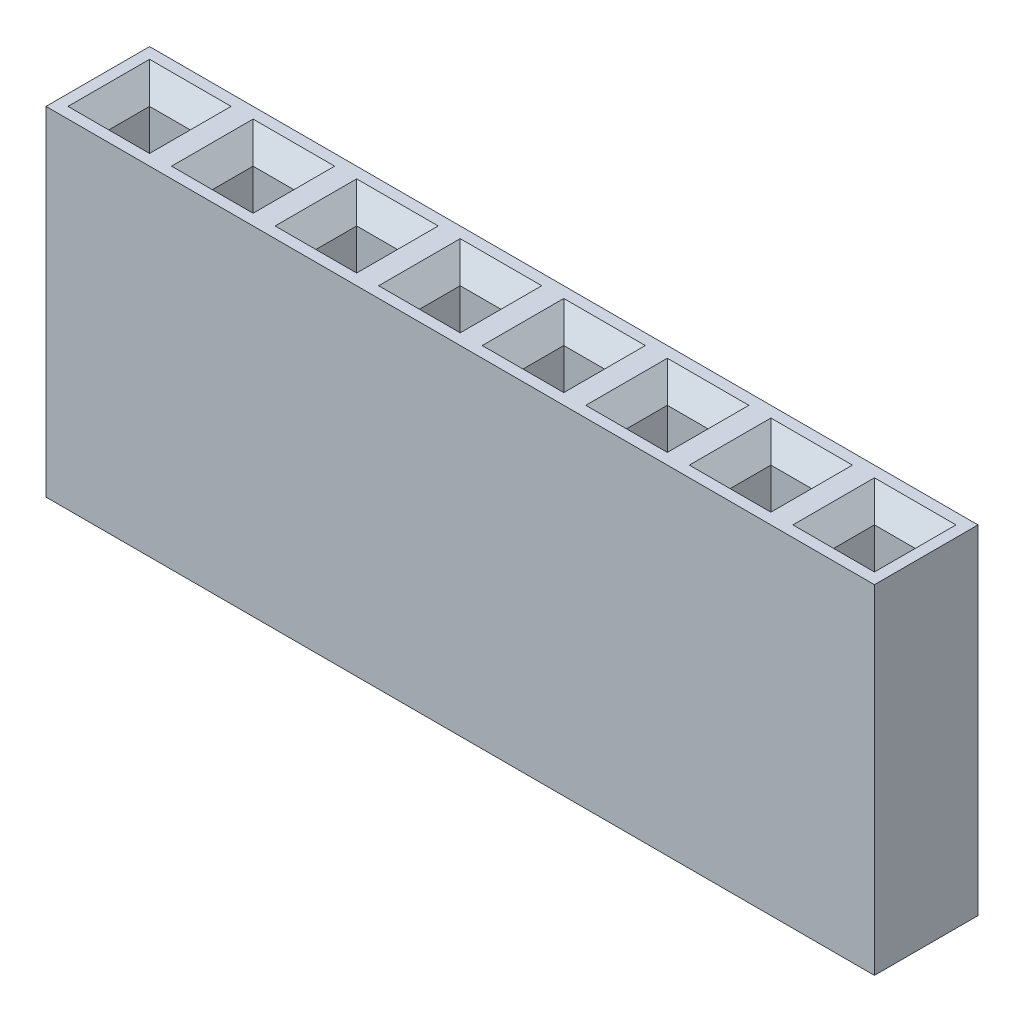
from build123d import *

# Parameters (mm, degrees)
SKETCH1_W                  = 2.54
SKETCH1_H                  = 2.54
BOSS_EXTRUDE1_DEPTH        = 8.3
SKETCH2_W                  = 1
SKETCH2_H                  = 1
CUT_EXTRUDE1_DEPTH         = 4
CHAMFER1_SIZE              = 0.5
LPATTERN1_COUNT            = 8
LPATTERN1_PITCH            = 2.54
CHAMFER1_OF_LPATTERN1_SIZE = 0.5


with BuildPart() as part:
    # Sketch1 → Boss-Extrude1 (new body)
    with BuildSketch(Plane(origin=(0, 0, 0), x_dir=(1, 0, 0), z_dir=(0, 1, 0))):
        Rectangle(SKETCH1_W, SKETCH1_H)
    boss_extrude1 = extrude(amount=BOSS_EXTRUDE1_DEPTH)

    # Sketch2 → Cut-Extrude1 (cut)
    with BuildSketch(Plane(origin=(0, 8.3, 0), x_dir=(-1, 0, 0), z_dir=(0, 1, 0))):
        Rectangle(SKETCH2_W, SKETCH2_H)
    cut_extrude1 = extrude(amount=-CUT_EXTRUDE1_DEPTH, mode=Mode.SUBTRACT)

    # Chamfer1
    chamfer1_edges = [part.edges().sort_by_distance(p)[0] for p in [
        (0, 8.3, 0.5),
        (0.5, 8.3, 0),
        (0, 8.3, -0.5),
        (-0.5, 8.3, 0),
    ]]
    chamfer(chamfer1_edges, length=CHAMFER1_SIZE)

    # LPattern1: Boss-Extrude1, Cut-Extrude1 ×8
    with Locations(*[(i * LPATTERN1_PITCH, 0, 0) for i in range(1, LPATTERN1_COUNT)]):
        add(boss_extrude1)
        add(cut_extrude1, mode=Mode.SUBTRACT)

    # Chamfer1 of LPattern1
    chamfer1_of_lpattern1_edges = [part.edges().sort_by_distance(p)[0] for p in [
        (2.54, 8.3, 0.5),
        (3.04, 8.3, 0),
        (2.54, 8.3, -0.5),
        (2.04, 8.3, 0),
        (5.08, 8.3, 0.5),
        (5.58, 8.3, 0),
        (5.08, 8.3, -0.5),
        (4.58, 8.3, 0),
        (7.62, 8.3, 0.5),
        (8.12, 8.3, 0),
        (7.62, 8.3, -0.5),
        (7.12, 8.3, 0),
        (10.16, 8.3, 0.5),
        (10.66, 8.3, 0),
        (10.16, 8.3, -0.5),
        (9.66, 8.3, 0),
        (12.7, 8.3, 0.5),
        (13.2, 8.3, 0),
        (12.7, 8.3, -0.5),
        (12.2, 8.3, 0),
        (15.24, 8.3, 0.5),
        (15.74, 8.3, 0),
        (15.24, 8.3, -0.5),
        (14.74, 8.3, 0),
        (17.78, 8.3, 0.5),
        (18.28, 8.3, 0),
        (17.78, 8.3, -0.5),
        (17.28, 8.3, 0),
    ]]
    chamfer(chamfer1_of_lpattern1_edges, length=CHAMFER1_OF_LPATTERN1_SIZE)


solid = part.part
